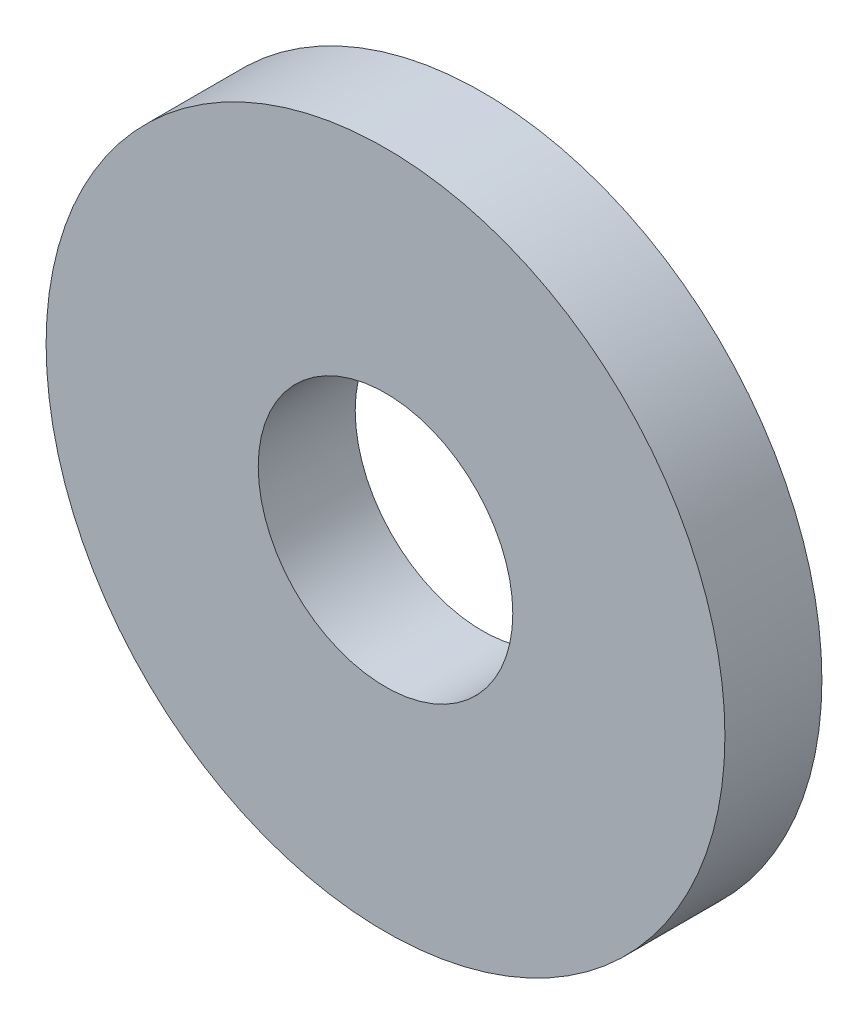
ISO-10303-21;
HEADER;
FILE_DESCRIPTION(('STEP AP214'),'2;1');
FILE_NAME('part.step','',(''),(''),'','','');
FILE_SCHEMA(('AUTOMOTIVE_DESIGN { 1 0 10303 214 1 1 1 1 }'));
ENDSEC;
DATA;
#1=APPLICATION_CONTEXT('core data for automotive mechanical design processes');
#2=APPLICATION_PROTOCOL_DEFINITION('international standard','automotive_design',2000,#1);
#3=PRODUCT_CONTEXT('',#1,'mechanical');
#4=PRODUCT('Part','Part','',(#3));
#5=PRODUCT_RELATED_PRODUCT_CATEGORY('part','',(#4));
#6=PRODUCT_DEFINITION_FORMATION('','',#4);
#7=PRODUCT_DEFINITION_CONTEXT('part definition',#1,'design');
#8=PRODUCT_DEFINITION('design','',#6,#7);
#9=PRODUCT_DEFINITION_SHAPE('','',#8);
#10=(LENGTH_UNIT() NAMED_UNIT(*) SI_UNIT(.MILLI.,.METRE.));
#11=(NAMED_UNIT(*) PLANE_ANGLE_UNIT() SI_UNIT($,.RADIAN.));
#12=(NAMED_UNIT(*) SI_UNIT($,.STERADIAN.) SOLID_ANGLE_UNIT());
#13=UNCERTAINTY_MEASURE_WITH_UNIT(LENGTH_MEASURE(1.E-05),#10,'distance_accuracy_value','');
#14=(GEOMETRIC_REPRESENTATION_CONTEXT(3) GLOBAL_UNCERTAINTY_ASSIGNED_CONTEXT((#13)) GLOBAL_UNIT_ASSIGNED_CONTEXT((#10,
#11,#12)) REPRESENTATION_CONTEXT('',''));
#15=CARTESIAN_POINT('',(0.,0.,0.));
#16=DIRECTION('',(0.,0.,1.));
#17=DIRECTION('',(1.,0.,0.));
#18=AXIS2_PLACEMENT_3D('',#15,#16,#17);
#19=CARTESIAN_POINT('',(0.,0.,4.));
#20=DIRECTION('',(0.,0.,1.));
#21=DIRECTION('',(1.,0.,0.));
#22=AXIS2_PLACEMENT_3D('',#19,#20,#21);
#23=PLANE('',#22);
#24=CARTESIAN_POINT('',(0.,0.,4.));
#25=DIRECTION('',(0.,0.,1.));
#26=DIRECTION('',(1.,0.,0.));
#27=AXIS2_PLACEMENT_3D('',#24,#25,#26);
#28=CIRCLE('',#27,14.);
#29=CARTESIAN_POINT('',(14.,0.,4.));
#30=VERTEX_POINT('',#29);
#31=EDGE_CURVE('E8',#30,#30,#28,.T.);
#32=ORIENTED_EDGE('',*,*,#31,.T.);
#33=EDGE_LOOP('',(#32));
#34=FACE_BOUND('',#33,.T.);
#35=CARTESIAN_POINT('',(0.,0.,4.));
#36=DIRECTION('',(0.,0.,1.));
#37=DIRECTION('',(1.,0.,0.));
#38=AXIS2_PLACEMENT_3D('',#35,#36,#37);
#39=CIRCLE('',#38,5.25);
#40=CARTESIAN_POINT('',(5.25,0.,4.));
#41=VERTEX_POINT('',#40);
#42=EDGE_CURVE('E23',#41,#41,#39,.T.);
#43=ORIENTED_EDGE('',*,*,#42,.F.);
#44=EDGE_LOOP('',(#43));
#45=FACE_BOUND('',#44,.T.);
#46=ADVANCED_FACE('F12',(#34,#45),#23,.T.);
#47=CARTESIAN_POINT('',(0.,0.,0.));
#48=DIRECTION('',(0.,0.,1.));
#49=DIRECTION('',(1.,0.,0.));
#50=AXIS2_PLACEMENT_3D('',#47,#48,#49);
#51=PLANE('',#50);
#52=CARTESIAN_POINT('',(0.,0.,0.));
#53=DIRECTION('',(0.,0.,1.));
#54=DIRECTION('',(1.,0.,0.));
#55=AXIS2_PLACEMENT_3D('',#52,#53,#54);
#56=CIRCLE('',#55,14.);
#57=CARTESIAN_POINT('',(14.,0.,0.));
#58=VERTEX_POINT('',#57);
#59=EDGE_CURVE('E19',#58,#58,#56,.T.);
#60=ORIENTED_EDGE('',*,*,#59,.F.);
#61=EDGE_LOOP('',(#60));
#62=FACE_BOUND('',#61,.T.);
#63=CARTESIAN_POINT('',(0.,0.,0.));
#64=DIRECTION('',(0.,0.,1.));
#65=DIRECTION('',(1.,0.,0.));
#66=AXIS2_PLACEMENT_3D('',#63,#64,#65);
#67=CIRCLE('',#66,5.25);
#68=CARTESIAN_POINT('',(5.25,0.,0.));
#69=VERTEX_POINT('',#68);
#70=EDGE_CURVE('E27',#69,#69,#67,.T.);
#71=ORIENTED_EDGE('',*,*,#70,.T.);
#72=EDGE_LOOP('',(#71));
#73=FACE_BOUND('',#72,.T.);
#74=ADVANCED_FACE('F33',(#62,#73),#51,.F.);
#75=CARTESIAN_POINT('',(0.,0.,4.));
#76=DIRECTION('',(0.,0.,-1.));
#77=DIRECTION('',(-1.,0.,0.));
#78=AXIS2_PLACEMENT_3D('',#75,#76,#77);
#79=CYLINDRICAL_SURFACE('',#78,14.);
#80=ORIENTED_EDGE('',*,*,#31,.F.);
#81=EDGE_LOOP('',(#80));
#82=FACE_BOUND('',#81,.T.);
#83=ORIENTED_EDGE('',*,*,#59,.T.);
#84=EDGE_LOOP('',(#83));
#85=FACE_BOUND('',#84,.T.);
#86=ADVANCED_FACE('F14',(#82,#85),#79,.T.);
#87=CARTESIAN_POINT('',(0.,0.,4.));
#88=DIRECTION('',(0.,0.,-1.));
#89=DIRECTION('',(-1.,0.,0.));
#90=AXIS2_PLACEMENT_3D('',#87,#88,#89);
#91=CYLINDRICAL_SURFACE('',#90,5.25);
#92=ORIENTED_EDGE('',*,*,#42,.T.);
#93=EDGE_LOOP('',(#92));
#94=FACE_BOUND('',#93,.T.);
#95=ORIENTED_EDGE('',*,*,#70,.F.);
#96=EDGE_LOOP('',(#95));
#97=FACE_BOUND('',#96,.T.);
#98=ADVANCED_FACE('F35',(#94,#97),#91,.F.);
#99=CLOSED_SHELL('',(#46,#74,#86,#98));
#100=MANIFOLD_SOLID_BREP('B1',#99);
#101=ADVANCED_BREP_SHAPE_REPRESENTATION('',(#18,#100),#14);
#102=SHAPE_DEFINITION_REPRESENTATION(#9,#101);
ENDSEC;
END-ISO-10303-21;
